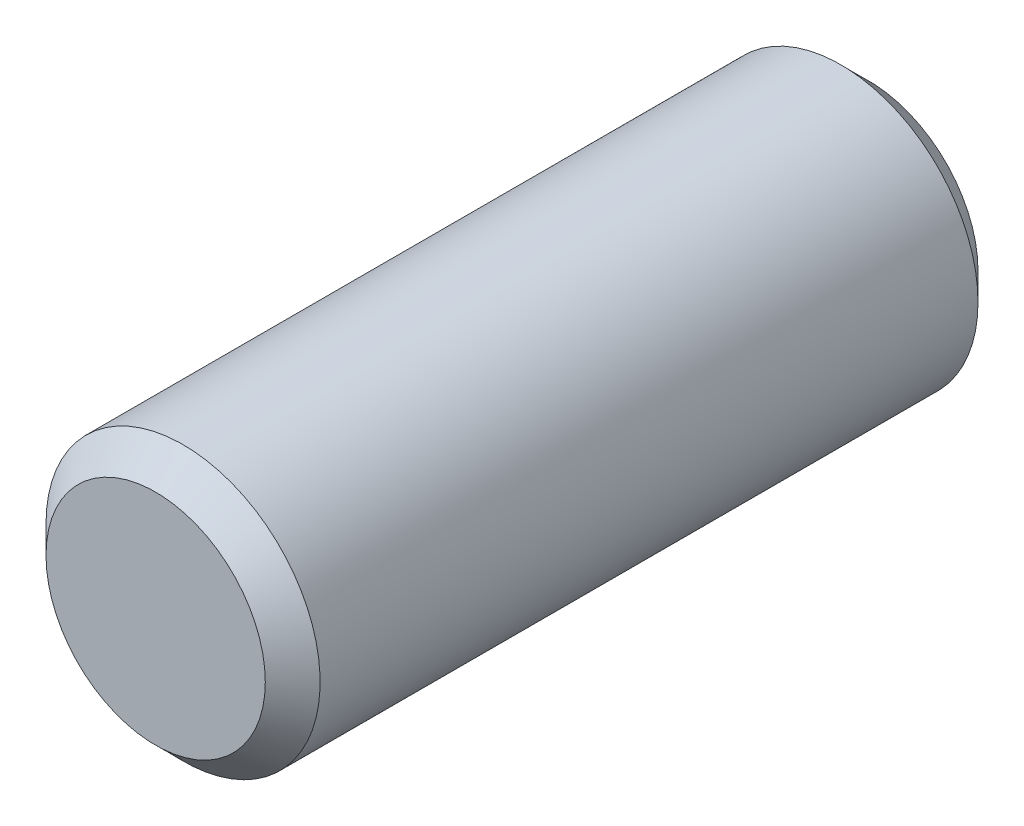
from build123d import *

# Parameters (mm, degrees)
SKETCH1_R           = 10
BOSS_EXTRUDE1_DEPTH = 26
CHAMFER1_SIZE       = 2


with BuildPart() as part:
    # Sketch1 → Boss-Extrude1 (new, symmetric)
    with BuildSketch(Plane.XY):
        with Locations(Location((0, 0, 0), (0, 0, 180))):
            Circle(SKETCH1_R)
    extrude(amount=BOSS_EXTRUDE1_DEPTH, both=True)

    # Chamfer1
    chamfer1_edges = [part.edges().sort_by_distance(p)[0] for p in [
        (10, 0, -26),
        (10, 0, 26),
    ]]
    chamfer(chamfer1_edges, length=CHAMFER1_SIZE)


solid = part.part
